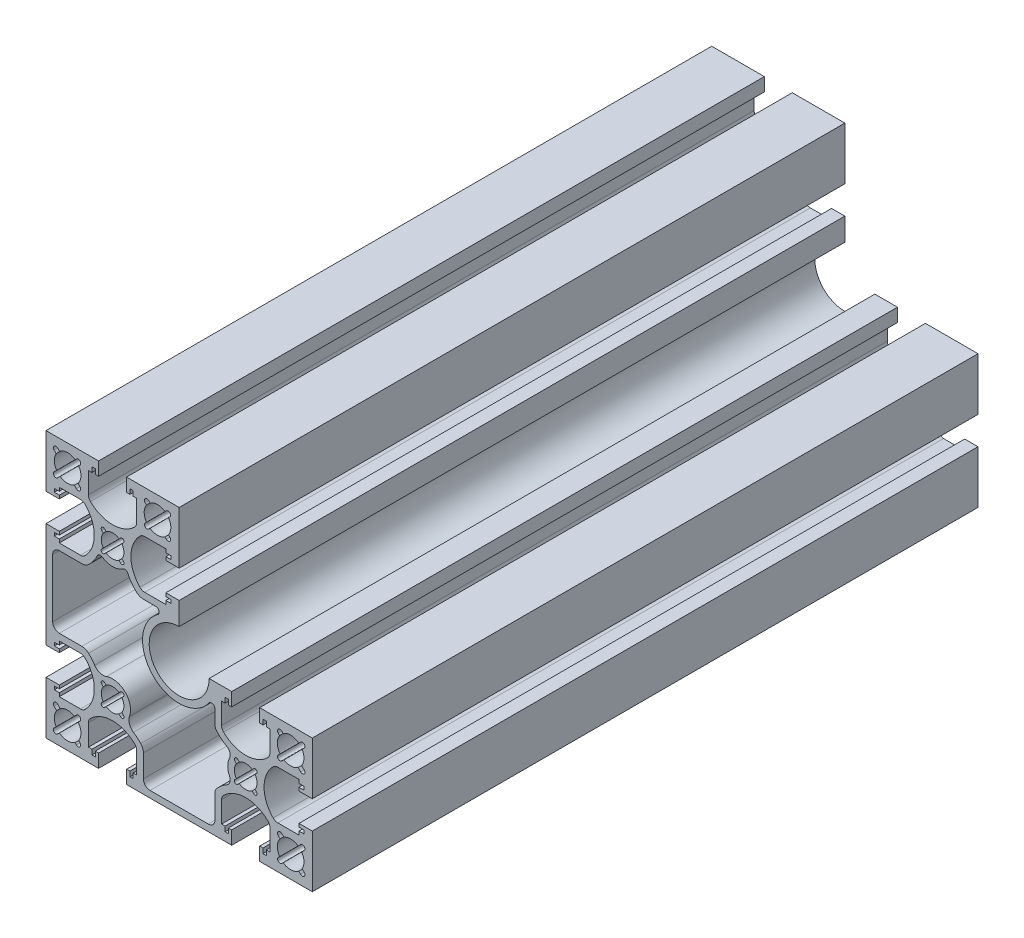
from build123d import *

# Parameters (mm, degrees)
EXTRUDE_1_DEPTH     = 100
SKETCH_2_R          = 4
SKETCH_2_R_2        = 3.4
CUT_EXTRUDE_1_DEPTH = 208.846096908
CUT_EXTRUDE_2_DEPTH = 208.846096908
CUT_EXTRUDE_3_DEPTH = 208.846096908
CUT_EXTRUDE_4_DEPTH = 208.846096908
FILLET_1_R          = 2


with BuildPart() as part:
    # Sketch 1 → Extrude 1 (new, symmetric)
    with BuildSketch(Plane.XY):
        with BuildLine():
            Line((0, 40), (0, 9))
            ThreePointArc((0, 9), (-6.363961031, -6.363961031), (9, 0))
            Line((9, 0), (40, 0))
            Line((40, 0), (40, -40))
            Line((40, -40), (-40, -40))
            Line((-40, -40), (-40, 40))
            Line((-40, 40), (0, 40))
        make_face()
    extrude(amount=EXTRUDE_1_DEPTH, both=True)

    # Sketch 2 → Cut-Extrude 1 (cut, through all)
    with BuildSketch(Plane.XY.offset(100)):
        with Locations((-33.5, 33.5)):
            Circle(SKETCH_2_R)
        with Locations((-6.5, 33.5)):
            Circle(SKETCH_2_R)
        with Locations((-20, 20)):
            Circle(SKETCH_2_R_2)
        with Locations(Location((-20, -20, 0), (0, 0, 180))):
            Circle(SKETCH_2_R_2)
        with Locations(Location((-33.5, -33.5, 0), (0, 0, 180))):
            Circle(SKETCH_2_R)
        with Locations((33.5, -33.5)):
            Circle(SKETCH_2_R)
        with Locations(Location((33.5, -6.5, 0), (0, 0, 180))):
            Circle(SKETCH_2_R)
        with Locations((20, -20)):
            Circle(SKETCH_2_R_2)
    extrude(amount=-CUT_EXTRUDE_1_DEPTH, mode=Mode.SUBTRACT)

    # Sketch 3 → Cut-Extrude 2 (cut, through all)
    with BuildSketch(Plane.XY.offset(100)):
        with BuildLine():
            Line((-29.787689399, 36.151650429), (-30.848349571, 35.090990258))
            ThreePointArc((-30.848349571, 35.090990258), (-31.909009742, 35.090990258), (-31.909009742, 36.151650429))
            Line((-31.909009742, 36.151650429), (-30.848349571, 37.212310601))
            ThreePointArc((-30.848349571, 37.212310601), (-29.787689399, 37.212310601), (-29.787689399, 36.151650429))
        make_face()
        with BuildLine():
            Line((-30.848349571, 29.434136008), (-31.909009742, 30.49479618))
            ThreePointArc((-31.909009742, 30.49479618), (-31.909009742, 31.555456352), (-30.848349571, 31.555456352))
            Line((-30.848349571, 31.555456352), (-29.787689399, 30.49479618))
            ThreePointArc((-29.787689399, 30.49479618), (-29.787689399, 29.434136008), (-30.848349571, 29.434136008))
        make_face()
        with BuildLine():
            Line((-37.565863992, 30.49479618), (-36.50520382, 31.555456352))
            ThreePointArc((-36.50520382, 31.555456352), (-35.444543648, 31.555456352), (-35.444543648, 30.49479618))
            Line((-35.444543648, 30.49479618), (-36.50520382, 29.434136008))
            ThreePointArc((-36.50520382, 29.434136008), (-37.565863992, 29.434136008), (-37.565863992, 30.49479618))
        make_face()
        with BuildLine():
            Line((-36.50520382, 37.212310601), (-35.444543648, 36.151650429))
            ThreePointArc((-35.444543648, 36.151650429), (-35.444543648, 35.090990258), (-36.50520382, 35.090990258))
            Line((-36.50520382, 35.090990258), (-37.565863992, 36.151650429))
            ThreePointArc((-37.565863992, 36.151650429), (-37.565863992, 37.212310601), (-36.50520382, 37.212310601))
        make_face()
        with BuildLine():
            Line((-2.787689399, 36.151650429), (-3.848349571, 35.090990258))
            ThreePointArc((-3.848349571, 35.090990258), (-4.909009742, 35.090990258), (-4.909009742, 36.151650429))
            Line((-4.909009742, 36.151650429), (-3.848349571, 37.212310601))
            ThreePointArc((-3.848349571, 37.212310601), (-2.787689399, 37.212310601), (-2.787689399, 36.151650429))
        make_face()
        with BuildLine():
            Line((-3.848349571, 29.787689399), (-4.909009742, 30.848349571))
            ThreePointArc((-4.909009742, 30.848349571), (-4.909009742, 31.909009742), (-3.848349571, 31.909009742))
            Line((-3.848349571, 31.909009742), (-2.787689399, 30.848349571))
            ThreePointArc((-2.787689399, 30.848349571), (-2.787689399, 29.787689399), (-3.848349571, 29.787689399))
        make_face()
        with BuildLine():
            Line((-10.212310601, 30.848349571), (-9.151650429, 31.909009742))
            ThreePointArc((-9.151650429, 31.909009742), (-8.090990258, 31.909009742), (-8.090990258, 30.848349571))
            Line((-8.090990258, 30.848349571), (-9.151650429, 29.787689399))
            ThreePointArc((-9.151650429, 29.787689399), (-10.212310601, 29.787689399), (-10.212310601, 30.848349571))
        make_face()
        with BuildLine():
            Line((-9.151650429, 37.212310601), (-8.090990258, 36.151650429))
            ThreePointArc((-8.090990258, 36.151650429), (-8.090990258, 35.090990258), (-9.151650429, 35.090990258))
            Line((-9.151650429, 35.090990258), (-10.212310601, 36.151650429))
            ThreePointArc((-10.212310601, 36.151650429), (-10.212310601, 37.212310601), (-9.151650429, 37.212310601))
        make_face()
        with BuildLine():
            Line((-16.747308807, 22.404163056), (-17.454415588, 21.697056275))
            ThreePointArc((-17.454415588, 21.697056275), (-18.302943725, 21.697056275), (-18.302943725, 22.545584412))
            Line((-18.302943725, 22.545584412), (-17.595836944, 23.252691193))
            ThreePointArc((-17.595836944, 23.252691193), (-16.747308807, 23.252691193), (-16.747308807, 22.404163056))
        make_face()
        with BuildLine():
            Line((-17.595836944, 16.747308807), (-18.302943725, 17.454415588))
            ThreePointArc((-18.302943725, 17.454415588), (-18.302943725, 18.302943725), (-17.454415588, 18.302943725))
            Line((-17.454415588, 18.302943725), (-16.747308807, 17.595836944))
            ThreePointArc((-16.747308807, 17.595836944), (-16.747308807, 16.747308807), (-17.595836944, 16.747308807))
        make_face()
        with BuildLine():
            Line((-23.252691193, 17.595836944), (-22.545584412, 18.302943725))
            ThreePointArc((-22.545584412, 18.302943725), (-21.697056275, 18.302943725), (-21.697056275, 17.454415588))
            Line((-21.697056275, 17.454415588), (-22.404163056, 16.747308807))
            ThreePointArc((-22.404163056, 16.747308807), (-23.252691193, 16.747308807), (-23.252691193, 17.595836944))
        make_face()
        with BuildLine():
            Line((-22.404163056, 23.252691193), (-21.697056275, 22.545584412))
            ThreePointArc((-21.697056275, 22.545584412), (-21.697056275, 21.697056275), (-22.545584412, 21.697056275))
            Line((-22.545584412, 21.697056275), (-23.252691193, 22.404163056))
            ThreePointArc((-23.252691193, 22.404163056), (-23.252691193, 23.252691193), (-22.404163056, 23.252691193))
        make_face()
        with BuildLine():
            Line((-22.404163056, -23.252691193), (-21.697056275, -22.545584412))
            ThreePointArc((-21.697056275, -22.545584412), (-21.697056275, -21.697056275), (-22.545584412, -21.697056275))
            Line((-22.545584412, -21.697056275), (-23.252691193, -22.404163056))
            ThreePointArc((-23.252691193, -22.404163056), (-23.252691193, -23.252691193), (-22.404163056, -23.252691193))
        make_face()
        with BuildLine():
            Line((-23.252691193, -17.595836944), (-22.545584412, -18.302943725))
            ThreePointArc((-22.545584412, -18.302943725), (-21.697056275, -18.302943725), (-21.697056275, -17.454415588))
            Line((-21.697056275, -17.454415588), (-22.404163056, -16.747308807))
            ThreePointArc((-22.404163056, -16.747308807), (-23.252691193, -16.747308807), (-23.252691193, -17.595836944))
        make_face()
        with BuildLine():
            Line((-17.595836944, -16.747308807), (-18.302943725, -17.454415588))
            ThreePointArc((-18.302943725, -17.454415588), (-18.302943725, -18.302943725), (-17.454415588, -18.302943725))
            Line((-17.454415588, -18.302943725), (-16.747308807, -17.595836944))
            ThreePointArc((-16.747308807, -17.595836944), (-16.747308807, -16.747308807), (-17.595836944, -16.747308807))
        make_face()
        with BuildLine():
            Line((-16.747308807, -22.404163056), (-17.454415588, -21.697056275))
            ThreePointArc((-17.454415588, -21.697056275), (-18.302943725, -21.697056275), (-18.302943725, -22.545584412))
            Line((-18.302943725, -22.545584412), (-17.595836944, -23.252691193))
            ThreePointArc((-17.595836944, -23.252691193), (-16.747308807, -23.252691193), (-16.747308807, -22.404163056))
        make_face()
        with BuildLine():
            Line((-36.50520382, -37.212310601), (-35.444543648, -36.151650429))
            ThreePointArc((-35.444543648, -36.151650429), (-35.444543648, -35.090990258), (-36.50520382, -35.090990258))
            Line((-36.50520382, -35.090990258), (-37.565863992, -36.151650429))
            ThreePointArc((-37.565863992, -36.151650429), (-37.565863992, -37.212310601), (-36.50520382, -37.212310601))
        make_face()
        with BuildLine():
            Line((-37.565863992, -30.49479618), (-36.50520382, -31.555456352))
            ThreePointArc((-36.50520382, -31.555456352), (-35.444543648, -31.555456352), (-35.444543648, -30.49479618))
            Line((-35.444543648, -30.49479618), (-36.50520382, -29.434136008))
            ThreePointArc((-36.50520382, -29.434136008), (-37.565863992, -29.434136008), (-37.565863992, -30.49479618))
        make_face()
        with BuildLine():
            Line((-30.848349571, -29.434136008), (-31.909009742, -30.49479618))
            ThreePointArc((-31.909009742, -30.49479618), (-31.909009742, -31.555456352), (-30.848349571, -31.555456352))
            Line((-30.848349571, -31.555456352), (-29.787689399, -30.49479618))
            ThreePointArc((-29.787689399, -30.49479618), (-29.787689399, -29.434136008), (-30.848349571, -29.434136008))
        make_face()
        with BuildLine():
            Line((-29.787689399, -36.151650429), (-30.848349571, -35.090990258))
            ThreePointArc((-30.848349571, -35.090990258), (-31.909009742, -35.090990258), (-31.909009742, -36.151650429))
            Line((-31.909009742, -36.151650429), (-30.848349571, -37.212310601))
            ThreePointArc((-30.848349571, -37.212310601), (-29.787689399, -37.212310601), (-29.787689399, -36.151650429))
        make_face()
        with BuildLine():
            Line((29.787689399, -36.151650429), (30.848349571, -35.090990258))
            ThreePointArc((30.848349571, -35.090990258), (31.909009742, -35.090990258), (31.909009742, -36.151650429))
            Line((31.909009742, -36.151650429), (30.848349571, -37.212310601))
            ThreePointArc((30.848349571, -37.212310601), (29.787689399, -37.212310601), (29.787689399, -36.151650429))
        make_face()
        with BuildLine():
            Line((30.848349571, -29.434136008), (31.909009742, -30.49479618))
            ThreePointArc((31.909009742, -30.49479618), (31.909009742, -31.555456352), (30.848349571, -31.555456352))
            Line((30.848349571, -31.555456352), (29.787689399, -30.49479618))
            ThreePointArc((29.787689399, -30.49479618), (29.787689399, -29.434136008), (30.848349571, -29.434136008))
        make_face()
        with BuildLine():
            Line((37.565863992, -30.49479618), (36.50520382, -31.555456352))
            ThreePointArc((36.50520382, -31.555456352), (35.444543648, -31.555456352), (35.444543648, -30.49479618))
            Line((35.444543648, -30.49479618), (36.50520382, -29.434136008))
            ThreePointArc((36.50520382, -29.434136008), (37.565863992, -29.434136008), (37.565863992, -30.49479618))
        make_face()
        with BuildLine():
            Line((36.50520382, -37.212310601), (35.444543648, -36.151650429))
            ThreePointArc((35.444543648, -36.151650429), (35.444543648, -35.090990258), (36.50520382, -35.090990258))
            Line((36.50520382, -35.090990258), (37.565863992, -36.151650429))
            ThreePointArc((37.565863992, -36.151650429), (37.565863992, -37.212310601), (36.50520382, -37.212310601))
        make_face()
        with BuildLine():
            Line((16.747308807, -22.404163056), (17.454415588, -21.697056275))
            ThreePointArc((17.454415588, -21.697056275), (18.302943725, -21.697056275), (18.302943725, -22.545584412))
            Line((18.302943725, -22.545584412), (17.595836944, -23.252691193))
            ThreePointArc((17.595836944, -23.252691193), (16.747308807, -23.252691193), (16.747308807, -22.404163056))
        make_face()
        with BuildLine():
            Line((17.595836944, -16.747308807), (18.302943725, -17.454415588))
            ThreePointArc((18.302943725, -17.454415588), (18.302943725, -18.302943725), (17.454415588, -18.302943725))
            Line((17.454415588, -18.302943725), (16.747308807, -17.595836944))
            ThreePointArc((16.747308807, -17.595836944), (16.747308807, -16.747308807), (17.595836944, -16.747308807))
        make_face()
        with BuildLine():
            Line((23.252691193, -17.595836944), (22.545584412, -18.302943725))
            ThreePointArc((22.545584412, -18.302943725), (21.697056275, -18.302943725), (21.697056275, -17.454415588))
            Line((21.697056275, -17.454415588), (22.404163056, -16.747308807))
            ThreePointArc((22.404163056, -16.747308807), (23.252691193, -16.747308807), (23.252691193, -17.595836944))
        make_face()
        with BuildLine():
            Line((22.404163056, -23.252691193), (21.697056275, -22.545584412))
            ThreePointArc((21.697056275, -22.545584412), (21.697056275, -21.697056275), (22.545584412, -21.697056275))
            Line((22.545584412, -21.697056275), (23.252691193, -22.404163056))
            ThreePointArc((23.252691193, -22.404163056), (23.252691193, -23.252691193), (22.404163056, -23.252691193))
        make_face()
        with BuildLine():
            Line((36.50520382, -2.787689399), (35.444543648, -3.848349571))
            ThreePointArc((35.444543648, -3.848349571), (35.444543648, -4.909009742), (36.50520382, -4.909009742))
            Line((36.50520382, -4.909009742), (37.565863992, -3.848349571))
            ThreePointArc((37.565863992, -3.848349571), (37.565863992, -2.787689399), (36.50520382, -2.787689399))
        make_face()
        with BuildLine():
            Line((37.565863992, -9.50520382), (36.50520382, -8.444543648))
            ThreePointArc((36.50520382, -8.444543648), (35.444543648, -8.444543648), (35.444543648, -9.50520382))
            Line((35.444543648, -9.50520382), (36.50520382, -10.565863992))
            ThreePointArc((36.50520382, -10.565863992), (37.565863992, -10.565863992), (37.565863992, -9.50520382))
        make_face()
        with BuildLine():
            Line((30.848349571, -10.565863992), (31.909009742, -9.50520382))
            ThreePointArc((31.909009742, -9.50520382), (31.909009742, -8.444543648), (30.848349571, -8.444543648))
            Line((30.848349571, -8.444543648), (29.787689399, -9.50520382))
            ThreePointArc((29.787689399, -9.50520382), (29.787689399, -10.565863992), (30.848349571, -10.565863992))
        make_face()
        with BuildLine():
            Line((29.787689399, -3.848349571), (30.848349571, -4.909009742))
            ThreePointArc((30.848349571, -4.909009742), (31.909009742, -4.909009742), (31.909009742, -3.848349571))
            Line((31.909009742, -3.848349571), (30.848349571, -2.787689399))
            ThreePointArc((30.848349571, -2.787689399), (29.787689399, -2.787689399), (29.787689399, -3.848349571))
        make_face()
    extrude(amount=-CUT_EXTRUDE_2_DEPTH, mode=Mode.SUBTRACT)

    # Sketch 4 → Cut-Extrude 3 (cut, through all)
    with BuildSketch(Plane.XY.offset(100)):
        with BuildLine():
            Line((-24.2, 40), (-24.2, 36))
            Line((-24.2, 36), (-25.2, 36))
            Line((-25.2, 36), (-25.2, 37.5))
            Line((-25.2, 37.5), (-26.2, 37.5))
            Line((-26.2, 37.5), (-26.2, 36))
            Line((-26.2, 36), (-27.25, 36))
            Line((-27.25, 36), (-27.25, 28.860985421))
            ThreePointArc((-27.25, 28.860985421), (-20, 25.5), (-12.75, 28.860985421))
            Line((-12.75, 28.860985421), (-12.75, 36))
            Line((-12.75, 36), (-13.8, 36))
            Line((-13.8, 36), (-13.8, 37.5))
            Line((-13.8, 37.5), (-14.8, 37.5))
            Line((-14.8, 37.5), (-14.8, 36))
            Line((-14.8, 36), (-15.8, 36))
            Line((-15.8, 36), (-15.8, 40))
            Line((-15.8, 40), (-24.2, 40))
        make_face()
        with BuildLine():
            Line((0, 24.2), (0, 15.8))
            Line((0, 15.8), (-4, 15.8))
            Line((-4, 15.8), (-4, 14.8))
            Line((-4, 14.8), (-2.5, 14.8))
            Line((-2.5, 14.8), (-2.5, 13.8))
            Line((-2.5, 13.8), (-4, 13.8))
            Line((-4, 13.8), (-4, 12.75))
            Line((-4, 12.75), (-11.139014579, 12.75))
            ThreePointArc((-11.139014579, 12.75), (-14.5, 20), (-11.139014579, 27.25))
            Line((-11.139014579, 27.25), (-4, 27.25))
            Line((-4, 27.25), (-4, 26.2))
            Line((-4, 26.2), (-2.5, 26.2))
            Line((-2.5, 26.2), (-2.5, 25.2))
            Line((-2.5, 25.2), (-4, 25.2))
            Line((-4, 25.2), (-4, 24.2))
            Line((-4, 24.2), (0, 24.2))
        make_face()
        with BuildLine():
            Line((-40, 15.8), (-40, 24.2))
            Line((-40, 24.2), (-36, 24.2))
            Line((-36, 24.2), (-36, 25.2))
            Line((-36, 25.2), (-37.5, 25.2))
            Line((-37.5, 25.2), (-37.5, 26.2))
            Line((-37.5, 26.2), (-36, 26.2))
            Line((-36, 26.2), (-36, 27.25))
            Line((-36, 27.25), (-28.860985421, 27.25))
            ThreePointArc((-28.860985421, 27.25), (-25.5, 20), (-28.860985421, 12.75))
            Line((-28.860985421, 12.75), (-36, 12.75))
            Line((-36, 12.75), (-36, 13.8))
            Line((-36, 13.8), (-37.5, 13.8))
            Line((-37.5, 13.8), (-37.5, 14.8))
            Line((-37.5, 14.8), (-36, 14.8))
            Line((-36, 14.8), (-36, 15.8))
            Line((-36, 15.8), (-40, 15.8))
        make_face()
        with BuildLine():
            Line((-40, -15.8), (-36, -15.8))
            Line((-36, -15.8), (-36, -14.8))
            Line((-36, -14.8), (-37.5, -14.8))
            Line((-37.5, -14.8), (-37.5, -13.8))
            Line((-37.5, -13.8), (-36, -13.8))
            Line((-36, -13.8), (-36, -12.75))
            Line((-36, -12.75), (-28.860985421, -12.75))
            ThreePointArc((-28.860985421, -12.75), (-25.5, -20), (-28.860985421, -27.25))
            Line((-28.860985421, -27.25), (-36, -27.25))
            Line((-36, -27.25), (-36, -26.2))
            Line((-36, -26.2), (-37.5, -26.2))
            Line((-37.5, -26.2), (-37.5, -25.2))
            Line((-37.5, -25.2), (-36, -25.2))
            Line((-36, -25.2), (-36, -24.2))
            Line((-36, -24.2), (-40, -24.2))
            Line((-40, -24.2), (-40, -15.8))
        make_face()
        with BuildLine():
            Line((12.75, -4), (12.75, -11.139014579))
            ThreePointArc((12.75, -11.139014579), (20, -14.5), (27.25, -11.139014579))
            Line((27.25, -11.139014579), (27.25, -4))
            Line((27.25, -4), (26.2, -4))
            Line((26.2, -4), (26.2, -2.5))
            Line((26.2, -2.5), (25.2, -2.5))
            Line((25.2, -2.5), (25.2, -4))
            Line((25.2, -4), (24.2, -4))
            Line((24.2, -4), (24.2, 0))
            Line((24.2, 0), (15.8, 0))
            Line((15.8, 0), (15.8, -4))
            Line((15.8, -4), (14.8, -4))
            Line((14.8, -4), (14.8, -2.5))
            Line((14.8, -2.5), (13.8, -2.5))
            Line((13.8, -2.5), (13.8, -4))
            Line((13.8, -4), (12.75, -4))
        make_face()
        with BuildLine():
            Line((-12.75, -36), (-12.75, -28.860985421))
            ThreePointArc((-12.75, -28.860985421), (-20, -25.5), (-27.25, -28.860985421))
            Line((-27.25, -28.860985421), (-27.25, -36))
            Line((-27.25, -36), (-26.2, -36))
            Line((-26.2, -36), (-26.2, -37.5))
            Line((-26.2, -37.5), (-25.2, -37.5))
            Line((-25.2, -37.5), (-25.2, -36))
            Line((-25.2, -36), (-24.2, -36))
            Line((-24.2, -36), (-24.2, -40))
            Line((-24.2, -40), (-15.8, -40))
            Line((-15.8, -40), (-15.8, -36))
            Line((-15.8, -36), (-14.8, -36))
            Line((-14.8, -36), (-14.8, -37.5))
            Line((-14.8, -37.5), (-13.8, -37.5))
            Line((-13.8, -37.5), (-13.8, -36))
            Line((-13.8, -36), (-12.75, -36))
        make_face()
        with BuildLine():
            Line((24.2, -40), (24.2, -36))
            Line((24.2, -36), (25.2, -36))
            Line((25.2, -36), (25.2, -37.5))
            Line((25.2, -37.5), (26.2, -37.5))
            Line((26.2, -37.5), (26.2, -36))
            Line((26.2, -36), (27.25, -36))
            Line((27.25, -36), (27.25, -28.860985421))
            ThreePointArc((27.25, -28.860985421), (20, -25.5), (12.75, -28.860985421))
            Line((12.75, -28.860985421), (12.75, -36))
            Line((12.75, -36), (13.8, -36))
            Line((13.8, -36), (13.8, -37.5))
            Line((13.8, -37.5), (14.8, -37.5))
            Line((14.8, -37.5), (14.8, -36))
            Line((14.8, -36), (15.8, -36))
            Line((15.8, -36), (15.8, -40))
            Line((15.8, -40), (24.2, -40))
        make_face()
        with BuildLine():
            Line((40, -15.8), (40, -24.2))
            Line((40, -24.2), (36, -24.2))
            Line((36, -24.2), (36, -25.2))
            Line((36, -25.2), (37.5, -25.2))
            Line((37.5, -25.2), (37.5, -26.2))
            Line((37.5, -26.2), (36, -26.2))
            Line((36, -26.2), (36, -27.25))
            Line((36, -27.25), (28.860985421, -27.25))
            ThreePointArc((28.860985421, -27.25), (25.5, -20), (28.860985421, -12.75))
            Line((28.860985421, -12.75), (36, -12.75))
            Line((36, -12.75), (36, -13.8))
            Line((36, -13.8), (37.5, -13.8))
            Line((37.5, -13.8), (37.5, -14.8))
            Line((37.5, -14.8), (36, -14.8))
            Line((36, -14.8), (36, -15.8))
            Line((36, -15.8), (40, -15.8))
        make_face()
    extrude(amount=-CUT_EXTRUDE_3_DEPTH, mode=Mode.SUBTRACT)

    # Sketch 5 → Cut-Extrude 4 (cut, through all)
    with BuildSketch(Plane.XY.offset(100)):
        with BuildLine():
            Line((-38, 8.75), (-38, -8.75))
            ThreePointArc((-38, -8.75), (-37.414213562, -10.164213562), (-36, -10.75))
            Line((-36, -10.75), (-29.239140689, -10.75))
            ThreePointArc((-29.239140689, -10.75), (-28.147730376, -10.955572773), (-27.205896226, -11.544117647))
            ThreePointArc((-27.205896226, -11.544117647), (-26.214008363, -12.580003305), (-25.358770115, -13.731293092))
            ThreePointArc((-25.358770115, -13.731293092), (-23.800066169, -14.939444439), (-21.828071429, -14.918843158))
            ThreePointArc((-21.828071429, -14.918843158), (-16.181623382, -16.181623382), (-14.918843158, -21.828071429))
            ThreePointArc((-14.918843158, -21.828071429), (-14.939444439, -23.800066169), (-13.731293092, -25.358770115))
            ThreePointArc((-13.731293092, -25.358770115), (-12.580003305, -26.214008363), (-11.544117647, -27.205896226))
            ThreePointArc((-11.544117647, -27.205896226), (-10.955572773, -28.147730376), (-10.75, -29.239140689))
            Line((-10.75, -29.239140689), (-10.75, -36))
            ThreePointArc((-10.75, -36), (-10.164213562, -37.414213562), (-8.75, -38))
            Line((-8.75, -38), (8.75, -38))
            ThreePointArc((8.75, -38), (10.164213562, -37.414213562), (10.75, -36))
            Line((10.75, -36), (10.75, -28.860985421))
            ThreePointArc((10.75, -28.860985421), (10.872151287, -28.172738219), (11.223684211, -27.568561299))
            ThreePointArc((11.223684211, -27.568561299), (12.666179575, -26.14194841), (14.336925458, -24.991024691))
            ThreePointArc((14.336925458, -24.991024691), (15.262373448, -23.842479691), (15.148788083, -22.371864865))
            ThreePointArc((15.148788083, -22.371864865), (14.6, -20), (15.148788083, -17.628135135))
            ThreePointArc((15.148788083, -17.628135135), (15.262373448, -16.157520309), (14.336925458, -15.008975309))
            ThreePointArc((14.336925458, -15.008975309), (12.666179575, -13.85805159), (11.223684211, -12.431438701))
            ThreePointArc((11.223684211, -12.431438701), (10.872151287, -11.827261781), (10.75, -11.139014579))
            Line((10.75, -11.139014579), (10.75, -6.99553429))
            ThreePointArc((10.75, -6.99553429), (10.056186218, -6.043562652), (8.9375, -6.412573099))
            ThreePointArc((8.9375, -6.412573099), (-7.778174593, -7.778174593), (-6.412573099, 8.9375))
            ThreePointArc((-6.412573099, 8.9375), (-6.043562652, 10.056186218), (-6.99553429, 10.75))
            Line((-6.99553429, 10.75), (-10.760859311, 10.75))
            ThreePointArc((-10.760859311, 10.75), (-11.852269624, 10.955572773), (-12.794103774, 11.544117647))
            ThreePointArc((-12.794103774, 11.544117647), (-14.293176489, 13.22601515), (-15.43556, 15.16791065))
            ThreePointArc((-15.43556, 15.16791065), (-16.081605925, 15.712961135), (-16.91440625, 15.568396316))
            ThreePointArc((-16.91440625, 15.568396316), (-20, 14.6), (-23.08559375, 15.568396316))
            ThreePointArc((-23.08559375, 15.568396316), (-23.918394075, 15.712961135), (-24.56444, 15.16791065))
            ThreePointArc((-24.56444, 15.16791065), (-25.706823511, 13.22601515), (-27.205896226, 11.544117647))
            ThreePointArc((-27.205896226, 11.544117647), (-28.147730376, 10.955572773), (-29.239140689, 10.75))
            Line((-29.239140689, 10.75), (-36, 10.75))
            ThreePointArc((-36, 10.75), (-37.414213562, 10.164213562), (-38, 8.75))
        make_face()
    extrude(amount=-CUT_EXTRUDE_4_DEPTH, mode=Mode.SUBTRACT)

    # Fillet 1
    fillet_1_edges = [part.edges().sort_by_distance(p)[0] for p in [
        (28.860985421, -27.25, 0),
        (28.860985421, -12.75, 0),
        (-12.75, 28.860985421, 0),
        (-27.25, 28.860985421, 0),
        (-11.139014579, 12.75, 0),
        (-11.139014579, 27.25, 0),
        (-28.860985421, 27.25, 0),
        (-28.860985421, 12.75, 0),
        (-28.860985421, -12.75, 0),
        (-28.860985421, -27.25, 0),
        (-27.25, -28.860985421, 0),
        (-12.75, -28.860985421, 0),
        (27.25, -11.139014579, 0),
        (12.75, -11.139014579, 0),
        (12.75, -28.860985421, 0),
        (27.25, -28.860985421, 0),
    ]]
    fillet(fillet_1_edges, radius=FILLET_1_R)


solid = part.part
